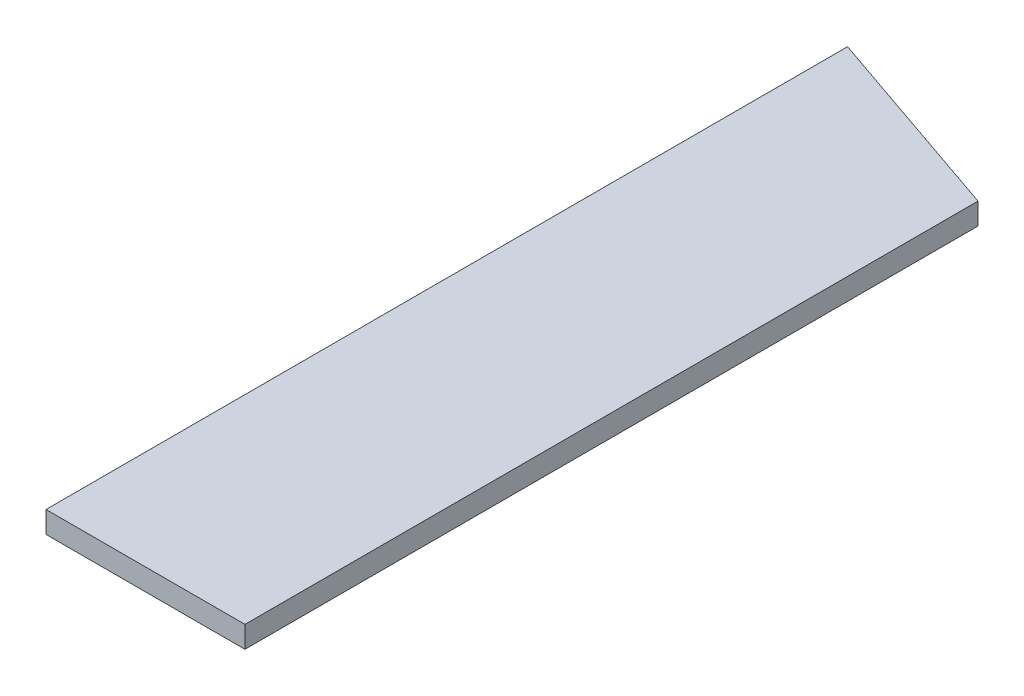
ISO-10303-21;
HEADER;
FILE_DESCRIPTION(('STEP AP214'),'2;1');
FILE_NAME('part.step','',(''),(''),'','','');
FILE_SCHEMA(('AUTOMOTIVE_DESIGN { 1 0 10303 214 1 1 1 1 }'));
ENDSEC;
DATA;
#1=APPLICATION_CONTEXT('core data for automotive mechanical design processes');
#2=APPLICATION_PROTOCOL_DEFINITION('international standard','automotive_design',2000,#1);
#3=PRODUCT_CONTEXT('',#1,'mechanical');
#4=PRODUCT('Part','Part','',(#3));
#5=PRODUCT_RELATED_PRODUCT_CATEGORY('part','',(#4));
#6=PRODUCT_DEFINITION_FORMATION('','',#4);
#7=PRODUCT_DEFINITION_CONTEXT('part definition',#1,'design');
#8=PRODUCT_DEFINITION('design','',#6,#7);
#9=PRODUCT_DEFINITION_SHAPE('','',#8);
#10=(LENGTH_UNIT() NAMED_UNIT(*) SI_UNIT(.MILLI.,.METRE.));
#11=(NAMED_UNIT(*) PLANE_ANGLE_UNIT() SI_UNIT($,.RADIAN.));
#12=(NAMED_UNIT(*) SI_UNIT($,.STERADIAN.) SOLID_ANGLE_UNIT());
#13=UNCERTAINTY_MEASURE_WITH_UNIT(LENGTH_MEASURE(1.E-05),#10,'distance_accuracy_value','');
#14=(GEOMETRIC_REPRESENTATION_CONTEXT(3) GLOBAL_UNCERTAINTY_ASSIGNED_CONTEXT((#13)) GLOBAL_UNIT_ASSIGNED_CONTEXT((#10,
#11,#12)) REPRESENTATION_CONTEXT('',''));
#15=CARTESIAN_POINT('',(0.,0.,0.));
#16=DIRECTION('',(0.,0.,1.));
#17=DIRECTION('',(1.,0.,0.));
#18=AXIS2_PLACEMENT_3D('',#15,#16,#17);
#19=CARTESIAN_POINT('',(584.199999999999,127.,-2361.30211));
#20=DIRECTION('',(-1.,0.,0.));
#21=DIRECTION('',(0.,0.,1.));
#22=AXIS2_PLACEMENT_3D('',#19,#20,#21);
#23=PLANE('',#22);
#24=DIRECTION('',(0.,0.,-1.));
#25=VECTOR('',#24,1.);
#26=CARTESIAN_POINT('',(584.199999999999,0.,-2361.30211));
#27=LINE('',#26,#25);
#28=CARTESIAN_POINT('',(584.2,0.,2361.30211));
#29=VERTEX_POINT('',#28);
#30=CARTESIAN_POINT('',(584.199999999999,0.,-1943.91975255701));
#31=VERTEX_POINT('',#30);
#32=EDGE_CURVE('E80',#29,#31,#27,.T.);
#33=ORIENTED_EDGE('',*,*,#32,.T.);
#34=DIRECTION('',(0.,-1.,0.));
#35=VECTOR('',#34,1.);
#36=CARTESIAN_POINT('',(584.2,127.,-1943.91975255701));
#37=LINE('',#36,#35);
#38=CARTESIAN_POINT('',(584.2,127.,-1943.91975255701));
#39=VERTEX_POINT('',#38);
#40=EDGE_CURVE('E46',#39,#31,#37,.T.);
#41=ORIENTED_EDGE('',*,*,#40,.F.);
#42=DIRECTION('',(0.,0.,-1.));
#43=VECTOR('',#42,1.);
#44=CARTESIAN_POINT('',(584.199999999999,127.,-2361.30211));
#45=LINE('',#44,#43);
#46=CARTESIAN_POINT('',(584.2,127.,2361.30211));
#47=VERTEX_POINT('',#46);
#48=EDGE_CURVE('E75',#47,#39,#45,.T.);
#49=ORIENTED_EDGE('',*,*,#48,.F.);
#50=DIRECTION('',(0.,-1.,0.));
#51=VECTOR('',#50,1.);
#52=CARTESIAN_POINT('',(584.2,127.,2361.30211));
#53=LINE('',#52,#51);
#54=EDGE_CURVE('E39',#47,#29,#53,.T.);
#55=ORIENTED_EDGE('',*,*,#54,.T.);
#56=EDGE_LOOP('',(#33,#41,#49,#55));
#57=FACE_BOUND('',#56,.T.);
#58=ADVANCED_FACE('F32',(#57),#23,.F.);
#59=CARTESIAN_POINT('',(-584.200000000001,127.,-2361.30211));
#60=DIRECTION('',(1.,0.,0.));
#61=DIRECTION('',(0.,0.,-1.));
#62=AXIS2_PLACEMENT_3D('',#59,#60,#61);
#63=PLANE('',#62);
#64=DIRECTION('',(0.,0.,1.));
#65=VECTOR('',#64,1.);
#66=CARTESIAN_POINT('',(-584.200000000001,127.,-2361.30211));
#67=LINE('',#66,#65);
#68=CARTESIAN_POINT('',(-584.200000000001,127.,-2346.23213592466));
#69=VERTEX_POINT('',#68);
#70=CARTESIAN_POINT('',(-584.2,127.,2361.30211));
#71=VERTEX_POINT('',#70);
#72=EDGE_CURVE('E89',#69,#71,#67,.T.);
#73=ORIENTED_EDGE('',*,*,#72,.F.);
#74=DIRECTION('',(0.,-1.,0.));
#75=VECTOR('',#74,1.);
#76=CARTESIAN_POINT('',(-584.200000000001,127.,-2346.23213592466));
#77=LINE('',#76,#75);
#78=CARTESIAN_POINT('',(-584.200000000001,0.,-2346.23213592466));
#79=VERTEX_POINT('',#78);
#80=EDGE_CURVE('E85',#69,#79,#77,.T.);
#81=ORIENTED_EDGE('',*,*,#80,.T.);
#82=DIRECTION('',(0.,0.,1.));
#83=VECTOR('',#82,1.);
#84=CARTESIAN_POINT('',(-584.200000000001,0.,-2361.30211));
#85=LINE('',#84,#83);
#86=CARTESIAN_POINT('',(-584.2,0.,2361.30211));
#87=VERTEX_POINT('',#86);
#88=EDGE_CURVE('E76',#79,#87,#85,.T.);
#89=ORIENTED_EDGE('',*,*,#88,.T.);
#90=DIRECTION('',(0.,-1.,0.));
#91=VECTOR('',#90,1.);
#92=CARTESIAN_POINT('',(-584.2,127.,2361.30211));
#93=LINE('',#92,#91);
#94=EDGE_CURVE('E11',#71,#87,#93,.T.);
#95=ORIENTED_EDGE('',*,*,#94,.F.);
#96=EDGE_LOOP('',(#73,#81,#89,#95));
#97=FACE_BOUND('',#96,.T.);
#98=ADVANCED_FACE('F104',(#97),#63,.F.);
#99=CARTESIAN_POINT('',(-584.2,127.,2361.30211));
#100=DIRECTION('',(0.,0.,-1.));
#101=DIRECTION('',(-1.,0.,0.));
#102=AXIS2_PLACEMENT_3D('',#99,#100,#101);
#103=PLANE('',#102);
#104=DIRECTION('',(1.,0.,0.));
#105=VECTOR('',#104,1.);
#106=CARTESIAN_POINT('',(-584.2,0.,2361.30211));
#107=LINE('',#106,#105);
#108=EDGE_CURVE('E67',#87,#29,#107,.T.);
#109=ORIENTED_EDGE('',*,*,#108,.T.);
#110=ORIENTED_EDGE('',*,*,#54,.F.);
#111=DIRECTION('',(1.,0.,0.));
#112=VECTOR('',#111,1.);
#113=CARTESIAN_POINT('',(-584.2,127.,2361.30211));
#114=LINE('',#113,#112);
#115=EDGE_CURVE('E55',#71,#47,#114,.T.);
#116=ORIENTED_EDGE('',*,*,#115,.F.);
#117=ORIENTED_EDGE('',*,*,#94,.T.);
#118=EDGE_LOOP('',(#109,#110,#116,#117));
#119=FACE_BOUND('',#118,.T.);
#120=ADVANCED_FACE('F69',(#119),#103,.F.);
#121=CARTESIAN_POINT('',(584.2,127.,2361.30211));
#122=DIRECTION('',(0.,1.,0.));
#123=DIRECTION('',(0.,0.,1.));
#124=AXIS2_PLACEMENT_3D('',#121,#122,#123);
#125=PLANE('',#124);
#126=DIRECTION('',(-0.945518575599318,0.,-0.325568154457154));
#127=VECTOR('',#126,1.);
#128=CARTESIAN_POINT('',(584.2,127.,-1943.91975255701));
#129=LINE('',#128,#127);
#130=EDGE_CURVE('E93',#39,#69,#129,.T.);
#131=ORIENTED_EDGE('',*,*,#130,.T.);
#132=ORIENTED_EDGE('',*,*,#72,.T.);
#133=ORIENTED_EDGE('',*,*,#115,.T.);
#134=ORIENTED_EDGE('',*,*,#48,.T.);
#135=EDGE_LOOP('',(#131,#132,#133,#134));
#136=FACE_BOUND('',#135,.T.);
#137=ADVANCED_FACE('F99',(#136),#125,.T.);
#138=CARTESIAN_POINT('',(584.2,0.,2361.30211));
#139=DIRECTION('',(0.,1.,0.));
#140=DIRECTION('',(0.,0.,1.));
#141=AXIS2_PLACEMENT_3D('',#138,#139,#140);
#142=PLANE('',#141);
#143=ORIENTED_EDGE('',*,*,#88,.F.);
#144=DIRECTION('',(-0.945518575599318,0.,-0.325568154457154));
#145=VECTOR('',#144,1.);
#146=CARTESIAN_POINT('',(584.2,0.,-1943.91975255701));
#147=LINE('',#146,#145);
#148=EDGE_CURVE('E82',#31,#79,#147,.T.);
#149=ORIENTED_EDGE('',*,*,#148,.F.);
#150=ORIENTED_EDGE('',*,*,#32,.F.);
#151=ORIENTED_EDGE('',*,*,#108,.F.);
#152=EDGE_LOOP('',(#143,#149,#150,#151));
#153=FACE_BOUND('',#152,.T.);
#154=ADVANCED_FACE('F81',(#153),#142,.F.);
#155=CARTESIAN_POINT('',(584.2,127.,-1943.91975255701));
#156=DIRECTION('',(-0.325568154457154,0.,0.945518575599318));
#157=DIRECTION('',(0.945518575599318,0.,0.325568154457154));
#158=AXIS2_PLACEMENT_3D('',#155,#156,#157);
#159=PLANE('',#158);
#160=ORIENTED_EDGE('',*,*,#148,.T.);
#161=ORIENTED_EDGE('',*,*,#80,.F.);
#162=ORIENTED_EDGE('',*,*,#130,.F.);
#163=ORIENTED_EDGE('',*,*,#40,.T.);
#164=EDGE_LOOP('',(#160,#161,#162,#163));
#165=FACE_BOUND('',#164,.T.);
#166=ADVANCED_FACE('F106',(#165),#159,.F.);
#167=CLOSED_SHELL('',(#58,#98,#120,#137,#154,#166));
#168=MANIFOLD_SOLID_BREP('B2',#167);
#169=ADVANCED_BREP_SHAPE_REPRESENTATION('',(#18,#168),#14);
#170=SHAPE_DEFINITION_REPRESENTATION(#9,#169);
ENDSEC;
END-ISO-10303-21;
